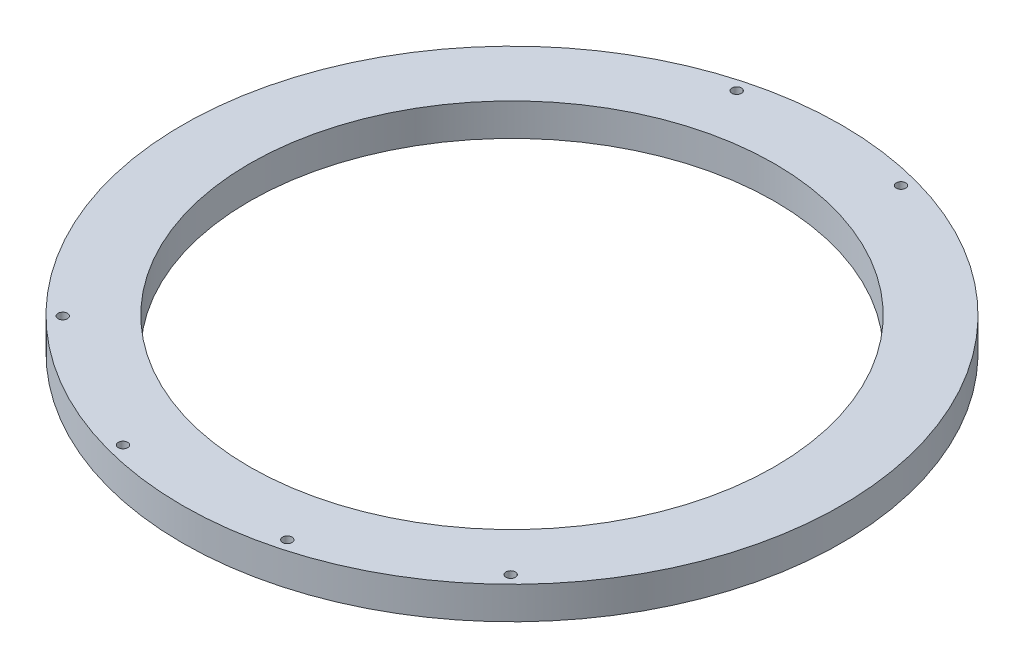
from build123d import *

# Parameters (mm, degrees)
SKETCH1_R           = 32.7152
SKETCH1_R_2         = 26.0604
BOSS_EXTRUDE1_DEPTH = 3.2258
SKETCH2_R           = 0.4699
CUT_EXTRUDE1_DEPTH  = 47.378598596


with BuildPart() as part:
    # Sketch1 → Boss-Extrude1 (new body)
    with BuildSketch(Plane(origin=(0, 0, 0), x_dir=(1, 0, 0), z_dir=(0, 1, 0))):
        with Locations(Location((0, 0, 0), (0, 0, 270))):
            Circle(SKETCH1_R)
        with Locations(Location((0, 0, 0), (0, 0, 270))):
            Circle(SKETCH1_R_2, mode=Mode.SUBTRACT)
    extrude(amount=BOSS_EXTRUDE1_DEPTH)

    # Sketch2 → Cut-Extrude1 (cut, through all)
    with BuildSketch(Plane(origin=(0, 3.2258, 0), x_dir=(1, 0, 0), z_dir=(0, 1, 0))):
        with Locations(Location((-8.1534, 30.461804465, 0), (0, 0, 270))):
            Circle(SKETCH2_R)
        with Locations(Location((8.1534, 30.461804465, 0), (0, 0, 270))):
            Circle(SKETCH2_R)
        with Locations(Location((-22.23135, -22.364403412, 0), (0, 0, 270))):
            Circle(SKETCH2_R)
        with Locations(Location((-8.1534, -30.461804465, 0), (0, 0, 270))):
            Circle(SKETCH2_R)
        with Locations(Location((8.1534, -30.461804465, 0), (0, 0, 270))):
            Circle(SKETCH2_R)
        with Locations(Location((22.23135, -22.364403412, 0), (0, 0, 270))):
            Circle(SKETCH2_R)
    extrude(amount=-CUT_EXTRUDE1_DEPTH, mode=Mode.SUBTRACT)


solid = part.part
